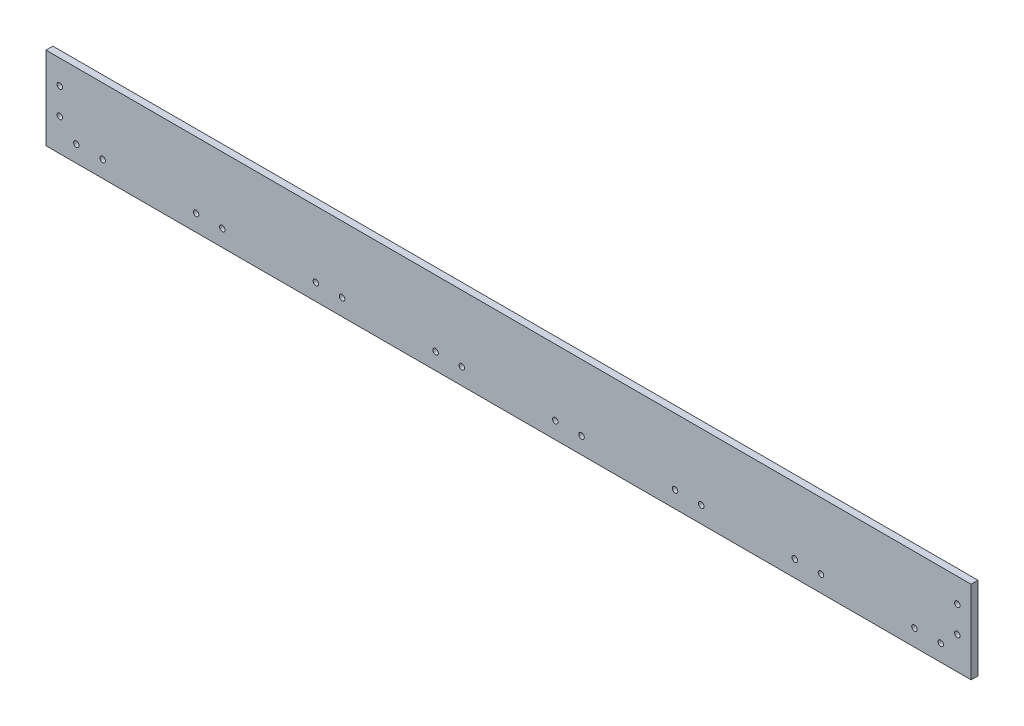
from build123d import *

# Parameters (mm, degrees)
SKETCH1_W           = 850.9
SKETCH1_H           = 76.2
BOSS_EXTRUDE1_DEPTH = 6.35
SKETCH2_R           = 2.54
CUT_EXTRUDE1_DEPTH  = 6.35
SKETCH3_R           = 2.54
CUT_EXTRUDE2_DEPTH  = 6.35
LPATTERN2_COUNT     = 8
LPATTERN2_PITCH     = 110.127142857


with BuildPart() as part:
    # Sketch1 → Boss-Extrude1 (new body)
    with BuildSketch(Plane.XY):
        with Locations((425.45, 38.1)):
            Rectangle(SKETCH1_W, SKETCH1_H)
    extrude(amount=BOSS_EXTRUDE1_DEPTH)

    # Sketch2 → Cut-Extrude1 (cut)
    with BuildSketch(Plane.XY.offset(6.35)):
        with Locations((27.94, 15.24)):
            Circle(SKETCH2_R)
        with Locations((52.07, 15.24)):
            Circle(SKETCH2_R)
    cut_extrude1 = extrude(amount=-CUT_EXTRUDE1_DEPTH, mode=Mode.SUBTRACT)

    # Sketch3 → Cut-Extrude2 (cut)
    with BuildSketch(Plane.XY.offset(6.35)):
        with Locations((12.7, 29.845)):
            Circle(SKETCH3_R)
        with Locations((12.7, 53.975)):
            Circle(SKETCH3_R)
        with Locations((838.2, 29.845)):
            Circle(SKETCH3_R)
        with Locations((838.2, 53.975)):
            Circle(SKETCH3_R)
    extrude(amount=-CUT_EXTRUDE2_DEPTH, mode=Mode.SUBTRACT)

    # LPattern2: Cut-Extrude1 ×8
    with Locations(*[(i * LPATTERN2_PITCH, 0, 0) for i in range(1, LPATTERN2_COUNT)]):
        add(cut_extrude1, mode=Mode.SUBTRACT)


solid = part.part
